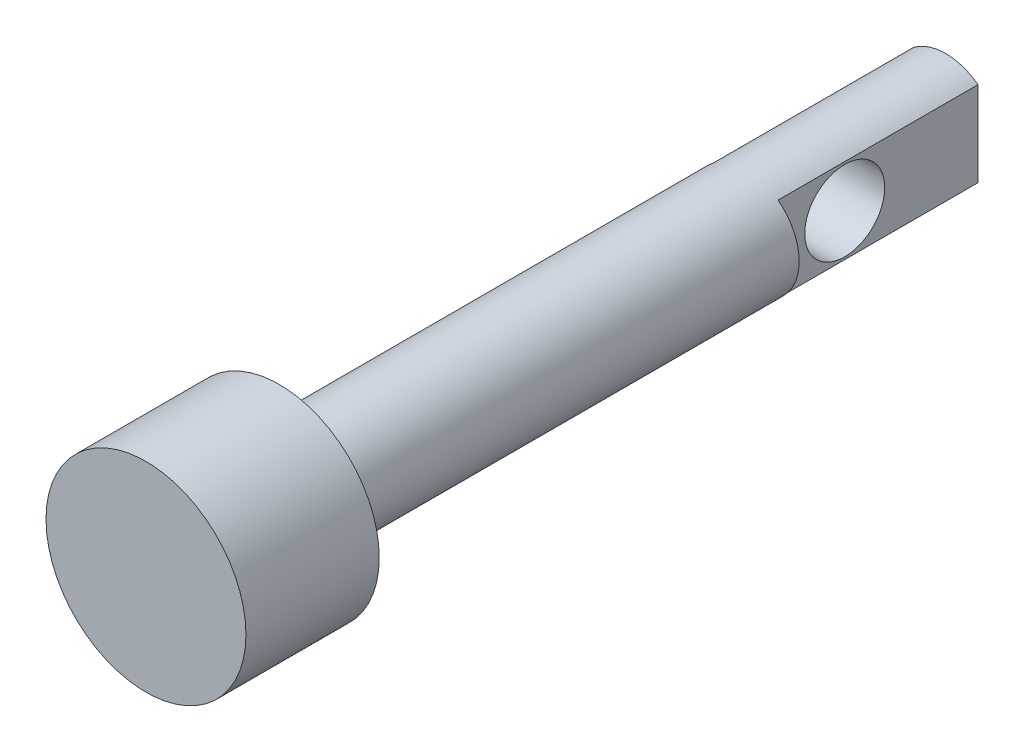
ISO-10303-21;
HEADER;
FILE_DESCRIPTION(('STEP AP214'),'2;1');
FILE_NAME('part.step','',(''),(''),'','','');
FILE_SCHEMA(('AUTOMOTIVE_DESIGN { 1 0 10303 214 1 1 1 1 }'));
ENDSEC;
DATA;
#1=APPLICATION_CONTEXT('core data for automotive mechanical design processes');
#2=APPLICATION_PROTOCOL_DEFINITION('international standard','automotive_design',2000,#1);
#3=PRODUCT_CONTEXT('',#1,'mechanical');
#4=PRODUCT('Part','Part','',(#3));
#5=PRODUCT_RELATED_PRODUCT_CATEGORY('part','',(#4));
#6=PRODUCT_DEFINITION_FORMATION('','',#4);
#7=PRODUCT_DEFINITION_CONTEXT('part definition',#1,'design');
#8=PRODUCT_DEFINITION('design','',#6,#7);
#9=PRODUCT_DEFINITION_SHAPE('','',#8);
#10=(LENGTH_UNIT() NAMED_UNIT(*) SI_UNIT(.MILLI.,.METRE.));
#11=(NAMED_UNIT(*) PLANE_ANGLE_UNIT() SI_UNIT($,.RADIAN.));
#12=(NAMED_UNIT(*) SI_UNIT($,.STERADIAN.) SOLID_ANGLE_UNIT());
#13=UNCERTAINTY_MEASURE_WITH_UNIT(LENGTH_MEASURE(1.E-05),#10,'distance_accuracy_value','');
#14=(GEOMETRIC_REPRESENTATION_CONTEXT(3) GLOBAL_UNCERTAINTY_ASSIGNED_CONTEXT((#13)) GLOBAL_UNIT_ASSIGNED_CONTEXT((#10,
#11,#12)) REPRESENTATION_CONTEXT('',''));
#15=CARTESIAN_POINT('',(0.,0.,0.));
#16=DIRECTION('',(0.,0.,1.));
#17=DIRECTION('',(1.,0.,0.));
#18=AXIS2_PLACEMENT_3D('',#15,#16,#17);
#19=CARTESIAN_POINT('',(0.,0.,60.));
#20=DIRECTION('',(0.,0.,1.));
#21=DIRECTION('',(1.,0.,0.));
#22=AXIS2_PLACEMENT_3D('',#19,#20,#21);
#23=CYLINDRICAL_SURFACE('',#22,8.);
#24=CARTESIAN_POINT('',(0.,0.,40.));
#25=DIRECTION('',(0.,0.,1.));
#26=DIRECTION('',(1.,0.,0.));
#27=AXIS2_PLACEMENT_3D('',#24,#25,#26);
#28=CIRCLE('',#27,8.);
#29=CARTESIAN_POINT('',(8.,0.,40.));
#30=VERTEX_POINT('',#29);
#31=EDGE_CURVE('E108',#30,#30,#28,.T.);
#32=ORIENTED_EDGE('',*,*,#31,.F.);
#33=EDGE_LOOP('',(#32));
#34=FACE_BOUND('',#33,.T.);
#35=CARTESIAN_POINT('',(0.,0.,-30.));
#36=DIRECTION('',(0.,0.,-1.));
#37=DIRECTION('',(-1.,0.,0.));
#38=AXIS2_PLACEMENT_3D('',#35,#36,#37);
#39=CIRCLE('',#38,8.);
#40=CARTESIAN_POINT('',(4.83911288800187,6.3704777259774,-30.));
#41=VERTEX_POINT('',#40);
#42=CARTESIAN_POINT('',(4.83911288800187,-6.3704777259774,-30.));
#43=VERTEX_POINT('',#42);
#44=EDGE_CURVE('E86',#41,#43,#39,.T.);
#45=ORIENTED_EDGE('',*,*,#44,.F.);
#46=DIRECTION('',(0.,0.,-1.));
#47=VECTOR('',#46,1.);
#48=CARTESIAN_POINT('',(4.83911288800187,6.3704777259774,-30.));
#49=LINE('',#48,#47);
#50=CARTESIAN_POINT('',(4.83911288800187,6.3704777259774,-60.));
#51=VERTEX_POINT('',#50);
#52=EDGE_CURVE('E76',#41,#51,#49,.T.);
#53=ORIENTED_EDGE('',*,*,#52,.T.);
#54=CARTESIAN_POINT('',(0.,0.,-60.));
#55=DIRECTION('',(0.,0.,1.));
#56=DIRECTION('',(1.,0.,0.));
#57=AXIS2_PLACEMENT_3D('',#54,#55,#56);
#58=CIRCLE('',#57,8.);
#59=CARTESIAN_POINT('',(-4.83911288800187,6.3704777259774,-60.));
#60=VERTEX_POINT('',#59);
#61=EDGE_CURVE('E11',#51,#60,#58,.T.);
#62=ORIENTED_EDGE('',*,*,#61,.T.);
#63=DIRECTION('',(0.,0.,-1.));
#64=VECTOR('',#63,1.);
#65=CARTESIAN_POINT('',(-4.83911288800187,6.3704777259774,-30.));
#66=LINE('',#65,#64);
#67=CARTESIAN_POINT('',(-4.83911288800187,6.3704777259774,-30.));
#68=VERTEX_POINT('',#67);
#69=EDGE_CURVE('E59',#68,#60,#66,.T.);
#70=ORIENTED_EDGE('',*,*,#69,.F.);
#71=CARTESIAN_POINT('',(0.,0.,-30.));
#72=DIRECTION('',(0.,0.,-1.));
#73=DIRECTION('',(-1.,0.,0.));
#74=AXIS2_PLACEMENT_3D('',#71,#72,#73);
#75=CIRCLE('',#74,8.);
#76=CARTESIAN_POINT('',(-4.83911288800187,-6.3704777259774,-30.));
#77=VERTEX_POINT('',#76);
#78=EDGE_CURVE('E98',#77,#68,#75,.T.);
#79=ORIENTED_EDGE('',*,*,#78,.F.);
#80=DIRECTION('',(0.,0.,-1.));
#81=VECTOR('',#80,1.);
#82=CARTESIAN_POINT('',(-4.83911288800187,-6.3704777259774,-30.));
#83=LINE('',#82,#81);
#84=CARTESIAN_POINT('',(-4.83911288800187,-6.3704777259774,-60.));
#85=VERTEX_POINT('',#84);
#86=EDGE_CURVE('E95',#77,#85,#83,.T.);
#87=ORIENTED_EDGE('',*,*,#86,.T.);
#88=CARTESIAN_POINT('',(4.83911288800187,-6.3704777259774,-60.));
#89=VERTEX_POINT('',#88);
#90=EDGE_CURVE('E43',#85,#89,#58,.T.);
#91=ORIENTED_EDGE('',*,*,#90,.T.);
#92=DIRECTION('',(0.,0.,-1.));
#93=VECTOR('',#92,1.);
#94=CARTESIAN_POINT('',(4.83911288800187,-6.3704777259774,-30.));
#95=LINE('',#94,#93);
#96=EDGE_CURVE('E51',#43,#89,#95,.T.);
#97=ORIENTED_EDGE('',*,*,#96,.F.);
#98=EDGE_LOOP('',(#45,#53,#62,#70,#79,#87,#91,#97));
#99=FACE_BOUND('',#98,.T.);
#100=ADVANCED_FACE('F35',(#34,#99),#23,.T.);
#101=CARTESIAN_POINT('',(0.,8.,-60.));
#102=DIRECTION('',(0.,0.,-1.));
#103=DIRECTION('',(-1.,0.,0.));
#104=AXIS2_PLACEMENT_3D('',#101,#102,#103);
#105=PLANE('',#104);
#106=ORIENTED_EDGE('',*,*,#61,.F.);
#107=DIRECTION('',(0.,-1.,0.));
#108=VECTOR('',#107,1.);
#109=CARTESIAN_POINT('',(4.83911288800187,0.,-60.));
#110=LINE('',#109,#108);
#111=EDGE_CURVE('E82',#51,#89,#110,.T.);
#112=ORIENTED_EDGE('',*,*,#111,.T.);
#113=ORIENTED_EDGE('',*,*,#90,.F.);
#114=DIRECTION('',(0.,-1.,0.));
#115=VECTOR('',#114,1.);
#116=CARTESIAN_POINT('',(-4.83911288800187,0.,-60.));
#117=LINE('',#116,#115);
#118=EDGE_CURVE('E101',#60,#85,#117,.T.);
#119=ORIENTED_EDGE('',*,*,#118,.F.);
#120=EDGE_LOOP('',(#106,#112,#113,#119));
#121=FACE_BOUND('',#120,.T.);
#122=ADVANCED_FACE('F132',(#121),#105,.T.);
#123=CARTESIAN_POINT('',(0.,0.,60.));
#124=DIRECTION('',(0.,0.,1.));
#125=DIRECTION('',(1.,0.,0.));
#126=AXIS2_PLACEMENT_3D('',#123,#124,#125);
#127=PLANE('',#126);
#128=CARTESIAN_POINT('',(0.,0.,60.));
#129=DIRECTION('',(0.,0.,1.));
#130=DIRECTION('',(1.,0.,0.));
#131=AXIS2_PLACEMENT_3D('',#128,#129,#130);
#132=CIRCLE('',#131,15.);
#133=CARTESIAN_POINT('',(15.,0.,60.));
#134=VERTEX_POINT('',#133);
#135=EDGE_CURVE('E114',#134,#134,#132,.T.);
#136=ORIENTED_EDGE('',*,*,#135,.T.);
#137=EDGE_LOOP('',(#136));
#138=FACE_BOUND('',#137,.T.);
#139=ADVANCED_FACE('F137',(#138),#127,.T.);
#140=CARTESIAN_POINT('',(0.,0.,60.));
#141=DIRECTION('',(0.,0.,1.));
#142=DIRECTION('',(1.,0.,0.));
#143=AXIS2_PLACEMENT_3D('',#140,#141,#142);
#144=CYLINDRICAL_SURFACE('',#143,15.);
#145=CARTESIAN_POINT('',(0.,0.,40.));
#146=DIRECTION('',(0.,0.,1.));
#147=DIRECTION('',(1.,0.,0.));
#148=AXIS2_PLACEMENT_3D('',#145,#146,#147);
#149=CIRCLE('',#148,15.);
#150=CARTESIAN_POINT('',(15.,0.,40.));
#151=VERTEX_POINT('',#150);
#152=EDGE_CURVE('E111',#151,#151,#149,.T.);
#153=ORIENTED_EDGE('',*,*,#152,.T.);
#154=EDGE_LOOP('',(#153));
#155=FACE_BOUND('',#154,.T.);
#156=ORIENTED_EDGE('',*,*,#135,.F.);
#157=EDGE_LOOP('',(#156));
#158=FACE_BOUND('',#157,.T.);
#159=ADVANCED_FACE('F145',(#155,#158),#144,.T.);
#160=CARTESIAN_POINT('',(0.,15.,40.));
#161=DIRECTION('',(0.,0.,-1.));
#162=DIRECTION('',(-1.,0.,0.));
#163=AXIS2_PLACEMENT_3D('',#160,#161,#162);
#164=PLANE('',#163);
#165=ORIENTED_EDGE('',*,*,#31,.T.);
#166=EDGE_LOOP('',(#165));
#167=FACE_BOUND('',#166,.T.);
#168=ORIENTED_EDGE('',*,*,#152,.F.);
#169=EDGE_LOOP('',(#168));
#170=FACE_BOUND('',#169,.T.);
#171=ADVANCED_FACE('F141',(#167,#170),#164,.T.);
#172=CARTESIAN_POINT('',(-4.83911288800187,0.,-30.));
#173=DIRECTION('',(1.,0.,0.));
#174=DIRECTION('',(0.,0.,-1.));
#175=AXIS2_PLACEMENT_3D('',#172,#173,#174);
#176=PLANE('',#175);
#177=ORIENTED_EDGE('',*,*,#118,.T.);
#178=ORIENTED_EDGE('',*,*,#86,.F.);
#179=DIRECTION('',(0.,-1.,0.));
#180=VECTOR('',#179,1.);
#181=CARTESIAN_POINT('',(-4.83911288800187,0.,-30.));
#182=LINE('',#181,#180);
#183=EDGE_CURVE('E100',#68,#77,#182,.T.);
#184=ORIENTED_EDGE('',*,*,#183,.F.);
#185=ORIENTED_EDGE('',*,*,#69,.T.);
#186=EDGE_LOOP('',(#177,#178,#184,#185));
#187=FACE_BOUND('',#186,.T.);
#188=CARTESIAN_POINT('',(-4.83911288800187,0.,-40.));
#189=DIRECTION('',(1.,0.,0.));
#190=DIRECTION('',(0.,0.,-1.));
#191=AXIS2_PLACEMENT_3D('',#188,#189,#190);
#192=CIRCLE('',#191,5.99999999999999);
#193=CARTESIAN_POINT('',(-4.83911288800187,0.,-46.));
#194=VERTEX_POINT('',#193);
#195=EDGE_CURVE('E96',#194,#194,#192,.F.);
#196=ORIENTED_EDGE('',*,*,#195,.F.);
#197=EDGE_LOOP('',(#196));
#198=FACE_BOUND('',#197,.T.);
#199=ADVANCED_FACE('F144',(#187,#198),#176,.F.);
#200=CARTESIAN_POINT('',(0.,0.,-30.));
#201=DIRECTION('',(0.,0.,-1.));
#202=DIRECTION('',(-1.,0.,0.));
#203=AXIS2_PLACEMENT_3D('',#200,#201,#202);
#204=PLANE('',#203);
#205=ORIENTED_EDGE('',*,*,#78,.T.);
#206=ORIENTED_EDGE('',*,*,#183,.T.);
#207=EDGE_LOOP('',(#205,#206));
#208=FACE_BOUND('',#207,.T.);
#209=ADVANCED_FACE('F173',(#208),#204,.T.);
#210=CARTESIAN_POINT('',(4.83911288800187,0.,-30.));
#211=DIRECTION('',(1.,0.,0.));
#212=DIRECTION('',(0.,0.,-1.));
#213=AXIS2_PLACEMENT_3D('',#210,#211,#212);
#214=PLANE('',#213);
#215=ORIENTED_EDGE('',*,*,#111,.F.);
#216=ORIENTED_EDGE('',*,*,#52,.F.);
#217=DIRECTION('',(0.,-1.,0.));
#218=VECTOR('',#217,1.);
#219=CARTESIAN_POINT('',(4.83911288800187,0.,-30.));
#220=LINE('',#219,#218);
#221=EDGE_CURVE('E80',#41,#43,#220,.T.);
#222=ORIENTED_EDGE('',*,*,#221,.T.);
#223=ORIENTED_EDGE('',*,*,#96,.T.);
#224=EDGE_LOOP('',(#215,#216,#222,#223));
#225=FACE_BOUND('',#224,.T.);
#226=CARTESIAN_POINT('',(4.83911288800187,0.,-40.));
#227=DIRECTION('',(1.,0.,0.));
#228=DIRECTION('',(0.,0.,-1.));
#229=AXIS2_PLACEMENT_3D('',#226,#227,#228);
#230=CIRCLE('',#229,5.99999999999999);
#231=CARTESIAN_POINT('',(4.83911288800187,0.,-46.));
#232=VERTEX_POINT('',#231);
#233=EDGE_CURVE('E38',#232,#232,#230,.F.);
#234=ORIENTED_EDGE('',*,*,#233,.T.);
#235=EDGE_LOOP('',(#234));
#236=FACE_BOUND('',#235,.T.);
#237=ADVANCED_FACE('F78',(#225,#236),#214,.T.);
#238=CARTESIAN_POINT('',(0.,0.,-30.));
#239=DIRECTION('',(0.,0.,-1.));
#240=DIRECTION('',(-1.,0.,0.));
#241=AXIS2_PLACEMENT_3D('',#238,#239,#240);
#242=PLANE('',#241);
#243=ORIENTED_EDGE('',*,*,#221,.F.);
#244=ORIENTED_EDGE('',*,*,#44,.T.);
#245=EDGE_LOOP('',(#243,#244));
#246=FACE_BOUND('',#245,.T.);
#247=ADVANCED_FACE('F89',(#246),#242,.T.);
#248=CARTESIAN_POINT('',(-15.,0.,-40.));
#249=DIRECTION('',(1.,0.,0.));
#250=DIRECTION('',(0.,0.,-1.));
#251=AXIS2_PLACEMENT_3D('',#248,#249,#250);
#252=CYLINDRICAL_SURFACE('',#251,5.99999999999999);
#253=ORIENTED_EDGE('',*,*,#195,.T.);
#254=EDGE_LOOP('',(#253));
#255=FACE_BOUND('',#254,.T.);
#256=ORIENTED_EDGE('',*,*,#233,.F.);
#257=EDGE_LOOP('',(#256));
#258=FACE_BOUND('',#257,.T.);
#259=ADVANCED_FACE('F122',(#255,#258),#252,.F.);
#260=CLOSED_SHELL('',(#100,#122,#139,#159,#171,#199,#209,#237,#247,#259));
#261=MANIFOLD_SOLID_BREP('B2',#260);
#262=ADVANCED_BREP_SHAPE_REPRESENTATION('',(#18,#261),#14);
#263=SHAPE_DEFINITION_REPRESENTATION(#9,#262);
ENDSEC;
END-ISO-10303-21;
